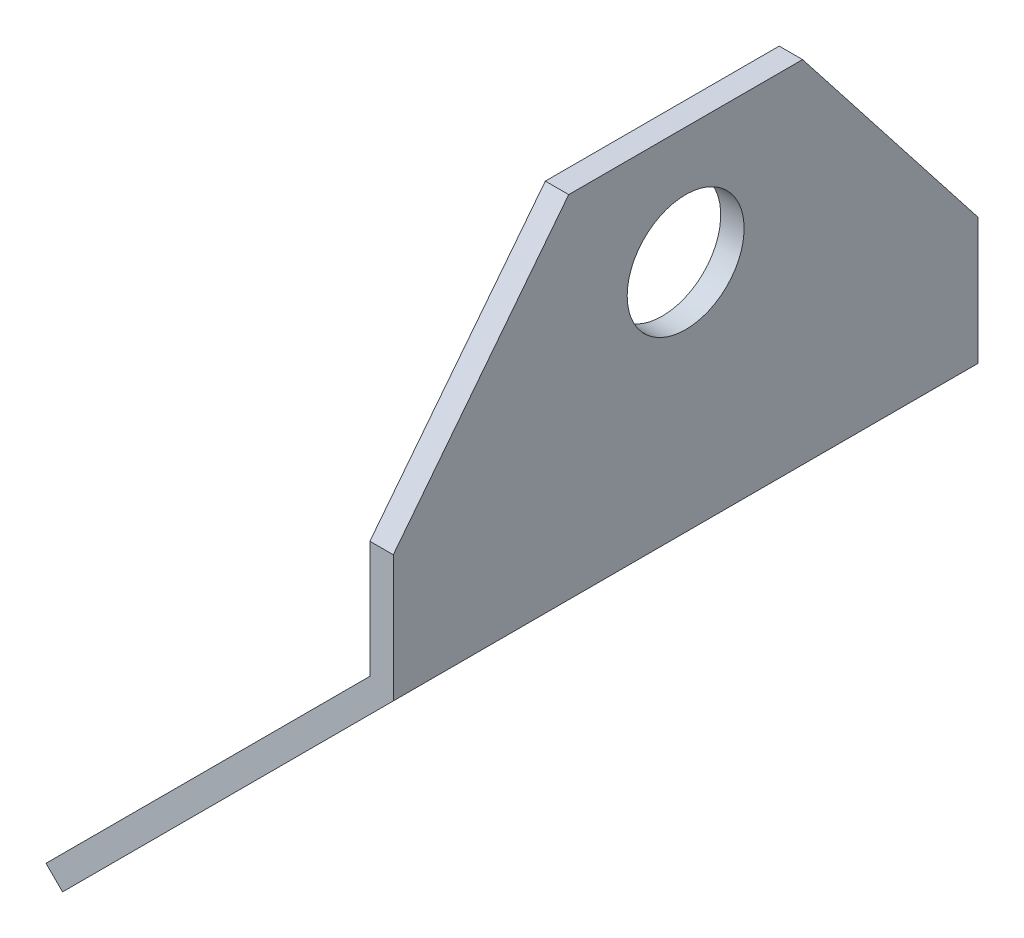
from build123d import *

# Parameters (mm, degrees)
ESTRUSIONE_SOTTILE1_DEPTH = 50
TAGLIO_ESTRUSIONE1_START  = -2
TAGLIO_ESTRUSIONE1_DEPTH  = 2
FORO_10_0_10_1_D          = 10
TAGLIO_ESTRUSIONE2_REACH  = 66.668
SCHIZZO6_R                = 4


with BuildPart() as part:
    # Schizzo2 → Estrusione-Sottile1 (new body)
    with BuildSketch(Plane.XY):
        Polygon((-28.284271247, -28.284271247), (0, 0), (0, 30), (-2, 30), (-2, 0.828427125), (-29.69848481, -26.870057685), align=None)
    extrude(amount=ESTRUSIONE_SOTTILE1_DEPTH)

    # Schizzo3 → Taglio-Estrusione1 (cut)
    with BuildSketch(Plane.ZY.offset(2).offset(TAGLIO_ESTRUSIONE1_START)):
        Polygon((-13.088548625, 19.60084457), (-12.319091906, 49.11054981), (50.002997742, 49.11054981), (54.141631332, 10.471935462), (50, 10.828427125), (35, 30), (15, 30), (0, 10.828427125), align=None)
    extrude(amount=TAGLIO_ESTRUSIONE1_DEPTH, mode=Mode.SUBTRACT)

    # Foro _10.0 _10_-1 (through all)
    with Locations(Plane(origin=(-2, 20, 25), x_dir=(0, 0, -1), z_dir=(-1, 0, 0))):
        with Locations((0, 0)):
            Hole(FORO_10_0_10_1_D / 2)

    # Schizzo6 → Taglio-Estrusione2 (cut, up to next)
    with BuildSketch(Plane(origin=(-1.414213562, 1.414213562, 0), x_dir=(0, 0, 1), z_dir=(-0.7071067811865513, 0.7071067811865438, 0)), mode=Mode.PRIVATE) as taglio_estrusione2_sk1:
        with Locations(Location((12.54, -20, 0), (0, 0, 270))):
            Circle(SCHIZZO6_R)
    taglio_estrusione2_tool1 = extrude(taglio_estrusione2_sk1.sketch, amount=-TAGLIO_ESTRUSIONE2_REACH, mode=Mode.PRIVATE) & part.part
    # Schizzo6 → Taglio-Estrusione2 (cut, up to next)
    with BuildSketch(Plane(origin=(-1.414213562, 1.414213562, 0), x_dir=(0, 0, 1), z_dir=(-0.7071067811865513, 0.7071067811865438, 0)), mode=Mode.PRIVATE) as taglio_estrusione2_sk2:
        with Locations(Location((37.46, -20, 0), (0, 0, 270))):
            Circle(SCHIZZO6_R)
    taglio_estrusione2_tool2 = extrude(taglio_estrusione2_sk2.sketch, amount=-TAGLIO_ESTRUSIONE2_REACH, mode=Mode.PRIVATE) & part.part
    add(taglio_estrusione2_tool1.solids().sort_by_distance((-15.556349, -12.727922, 12.54))[0], mode=Mode.SUBTRACT)
    add(taglio_estrusione2_tool2.solids().sort_by_distance((-15.556349, -12.727922, 37.46))[0], mode=Mode.SUBTRACT)


solid = part.part
